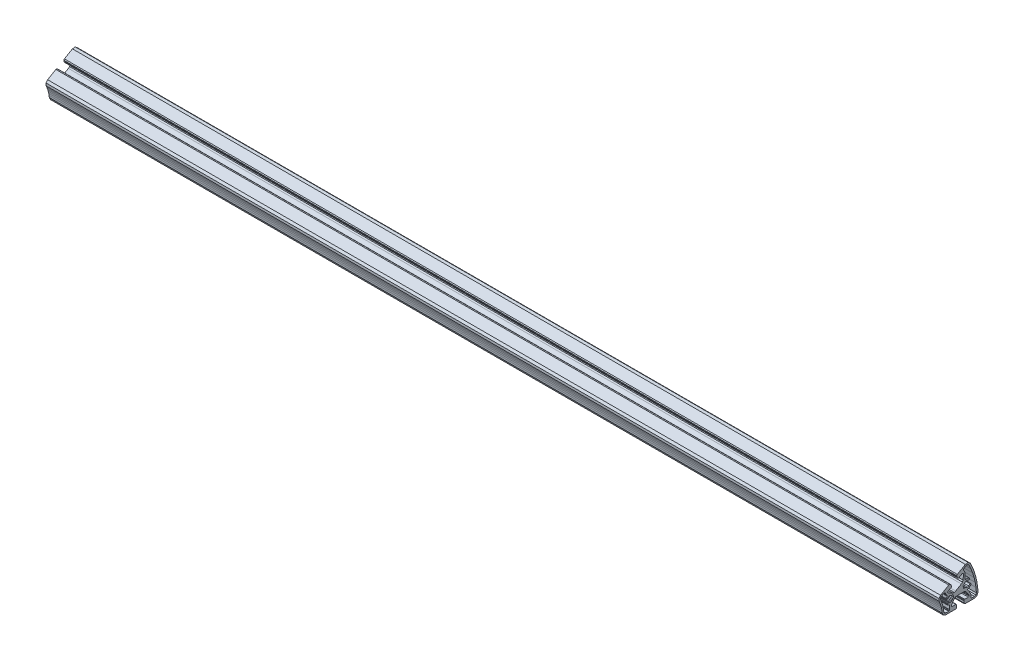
from build123d import *

# Parameters (mm, degrees)
STRUKTURBAUTEIL1_DEPTH = 1000


with BuildPart() as part:
    # Model → Strukturbauteil1 (new body)
    with BuildSketch(Plane(origin=(0, 0, 0), x_dir=(0, 0, -1), z_dir=(1, 0, 0))):
        Polygon((-14.137744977, -15.529142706), (-3.455549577, -15.529142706), (-2.394889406, -15.089802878), (-1.955549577, -14.029142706), (-1.955549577, -12.029142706), (-2.248442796, -11.322035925), (-2.955549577, -11.029142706), (-7.055549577, -11.029142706), (-7.89526301, -10.572172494), (-7.967528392, -9.618905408), (-4.690460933, -4.711893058), (-3.270118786, -3.634157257), (-1.62267195, -3.279142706), (5.711572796, -3.279142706), (7.359019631, -3.634157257), (8.779361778, -4.711893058), (12.011973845, -9.529339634), (11.984163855, -10.572172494), (11.144450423, -11.029142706), (7.044450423, -11.029142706), (6.337343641, -11.322035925), (6.044450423, -12.029142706), (6.044450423, -14.029142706), (6.483790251, -15.089802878), (7.544450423, -15.529142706), (17.939114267, -15.529142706), (20.823756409, -14.300214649), (21.933570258, -11.31861639), (21.446216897, -5.763924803), (20.573118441, -0.256674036), (19.318516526, 5.176380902), (17.688506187, 10.508845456), (15.691006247, 15.714813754), (13.335720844, 20.768994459), (10.883794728, 22.79622737), (7.771157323, 22.418189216), (-1.230885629, 17.220857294), (-1.929774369, 16.310047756), (-1.779923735, 15.171819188), (-0.779923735, 13.439768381), (-0.172717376, 12.973842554), (0.586101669, 13.073742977), (4.136805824, 15.123742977), (5.092504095, 15.147851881), (5.631721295, 14.358431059), (5.2472038, 8.470299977), (4.556019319, 6.826782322), (3.306795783, 5.695607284), (-3.044846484, 2.028484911), (-4.649084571, 1.512213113), (-6.323573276, 1.702486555), (-11.626252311, 4.291113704), (-12.123584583, 5.208138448), (-11.624856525, 6.023742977), (-8.074152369, 8.073742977), (-7.608226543, 8.680949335), (-7.708126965, 9.439768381), (-8.708126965, 11.171819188), (-9.618936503, 11.870707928), (-10.757165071, 11.720857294), (-20.008217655, 6.379759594), (-21.813175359, 4.149471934), (-21.660469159, 1.284382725), (-20.744665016, -0.85433197), (-19.970069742, -2.995056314), (-19.318516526, -5.176380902), (-18.792115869, -7.391240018), (-18.392572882, -9.632459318), (-18.121181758, -11.892779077), (-16.816023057, -14.50014027), align=None)
        with BuildLine():
            Line((6.055303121, -0.189219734), (7.296472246, 0.14335053))
            Line((7.296472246, 0.14335053), (8.56621683, -0.631322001))
            Line((8.56621683, -0.631322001), (10.0451492, -0.789839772))
            Line((10.0451492, -0.789839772), (11.450229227, -0.301865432))
            Line((11.450229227, -0.301865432), (12.567169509, 0.822971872))
            Line((12.567169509, 0.822971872), (13.125372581, 1.185626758))
            Line((13.125372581, 1.185626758), (13.780107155, 1.065494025))
            Line((13.780107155, 1.065494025), (14.173201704, 0.528292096))
            Line((14.173201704, 0.528292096), (14.089614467, -0.132103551))
            Line((14.089614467, -0.132103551), (13.464229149, -0.956128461))
            Line((13.464229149, -0.956128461), (12.767974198, -1.580248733))
            Line((12.767974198, -1.580248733), (11.971203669, -2.069588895))
            Line((11.971203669, -2.069588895), (11.00374581, -2.436533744))
            Line((11.00374581, -2.436533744), (10.60753036, -2.683043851))
            Line((10.60753036, -2.683043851), (10.3663105, -3.082502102))
            Line((10.3663105, -3.082502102), (10.332612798, -3.5479249))
            Line((10.332612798, -3.5479249), (10.575965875, -4.05626438))
            Line((10.575965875, -4.05626438), (12.216227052, -6.304042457))
            Line((12.216227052, -6.304042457), (13.65975099, -8.798995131))
            Line((13.65975099, -8.798995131), (13.872347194, -9.39781141))
            Line((13.872347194, -9.39781141), (13.944450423, -10.029142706))
            Line((13.944450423, -10.029142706), (13.944450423, -12.729142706))
            Line((13.944450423, -12.729142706), (14.237343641, -13.436249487))
            Line((14.237343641, -13.436249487), (14.944450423, -13.729142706))
            Line((14.944450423, -13.729142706), (17.939114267, -13.729142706))
            Line((17.939114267, -13.729142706), (19.517852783, -13.06132569))
            Line((19.517852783, -13.06132569), (20.133417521, -11.363423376))
            Line((20.133417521, -11.363423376), (19.65560126, -5.950559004))
            Line((19.65560126, -5.950559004), (18.803039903, -0.583944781))
            Line((18.803039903, -0.583944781), (17.579850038, 4.710506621))
            Line((17.579850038, 4.710506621), (15.991937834, 9.907230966))
            Line((15.991937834, 9.907230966), (14.046970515, 14.981135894))
            Line((14.046970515, 14.981135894), (11.75433935, 19.907722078))
            Line((11.75433935, 19.907722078), (10.372293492, 21.070366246))
            Line((10.372293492, 21.070366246), (8.671157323, 20.859343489))
            Line((8.671157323, 20.859343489), (6.077702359, 19.362011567))
            Line((6.077702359, 19.362011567), (5.711676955, 17.995986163))
            Line((5.711676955, 17.995986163), (7.061676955, 15.657717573))
            Line((7.061676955, 15.657717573), (7.435678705, 14.350180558))
            ThreePointArc((7.435678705, 14.350180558), (7.427541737, 11.567574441), (7.130922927, 8.800810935))
            Line((7.130922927, 8.800810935), (7.436237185, 7.852680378))
            Line((7.436237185, 7.852680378), (8.408441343, 7.635512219))
            Line((8.408441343, 7.635512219), (9.332572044, 7.777918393))
            Line((9.332572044, 7.777918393), (10.267265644, 7.752522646))
            Line((10.267265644, 7.752522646), (11.182300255, 7.560146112))
            Line((11.182300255, 7.560146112), (12.135912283, 7.159212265))
            Line((12.135912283, 7.159212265), (12.538498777, 6.629086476))
            Line((12.538498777, 6.629086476), (12.466669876, 5.967308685))
            Line((12.466669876, 5.967308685), (11.959719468, 5.535903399))
            Line((11.959719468, 5.535903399), (11.294973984, 5.570870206))
            Line((11.294973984, 5.570870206), (9.765256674, 5.986537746))
            Line((9.765256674, 5.986537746), (8.304434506, 5.706595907))
            Line((8.304434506, 5.706595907), (7.102900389, 4.829849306))
            Line((7.102900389, 4.829849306), (6.390605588, 3.524090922))
            Line((6.390605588, 3.524090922), (5.149436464, 3.191520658))
            Line((5.149436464, 3.191520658), (6.055303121, -0.189219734))
        make_face(mode=Mode.SUBTRACT)
        Polygon((-9.855549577, -8.671683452), (-9.855549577, -12.729142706), (-10.148442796, -13.436249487), (-10.855549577, -13.729142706), (-14.137744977, -13.729142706), (-15.602420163, -13.170704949), (-16.32352269, -11.778894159), (-16.617164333, -9.334152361), (-17.033153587, -7.008725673), (-17.579848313, -4.710513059), (-18.255502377, -2.446854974), (-19.057957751, -0.224981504), (-20.02602705, 2.039047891), (-20.097446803, 3.604948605), (-19.108217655, 4.820913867), (-16.265753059, 6.462011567), (-15.506934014, 6.56191199), (-14.899727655, 6.095986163), (-12.870998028, 2.582123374), (-12.746767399, 1.94286466), (-13.116824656, 1.295781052), (-13.614652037, 0.787436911), (-14.038426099, 0.215893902), (-14.173913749, -0.529853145), (-13.780633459, -1.066919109), (-13.125857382, -1.186825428), (-12.513189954, -0.740198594), (-11.855003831, 0.007710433), (-11.00828429, 0.532727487), (-10.045733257, 0.789773), (-9.049998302, 0.75677626), (-8.106576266, 0.436570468), (-7.296472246, -0.14335053), (-6.055303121, 0.189219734), (-5.149436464, -3.191520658), (-6.390605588, -3.524090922), (-6.80221575, -4.431369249), (-7.459140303, -5.180386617), (-8.3049737, -5.70683011), (-9.267090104, -5.965497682), (-10.262879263, -5.934179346), (-11.20683968, -5.61556419), (-11.960738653, -5.535107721), (-12.46783821, -5.966337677), (-12.53989595, -6.628090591), (-12.137492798, -7.158355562), (-10.711612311, -7.680591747), (-10.067591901, -8.055954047), align=None, mode=Mode.SUBTRACT)
    extrude(amount=STRUKTURBAUTEIL1_DEPTH)


solid = part.part
